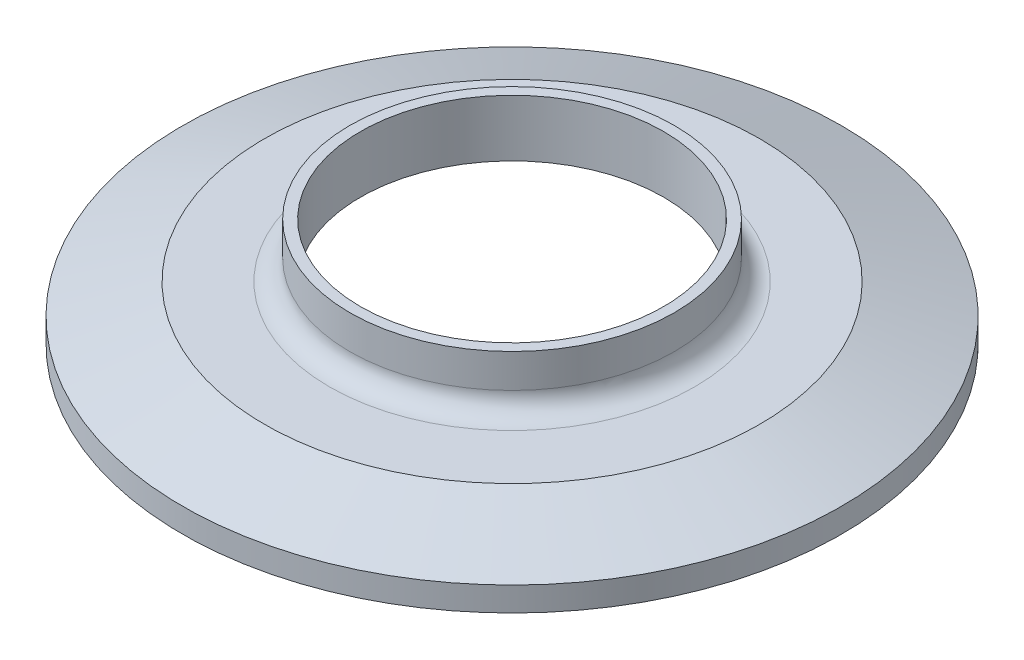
from build123d import *


with BuildPart() as part:
    # Sketch1 → Revolve1 (revolve)
    with BuildSketch(Plane.XY, mode=Mode.PRIVATE) as revolve1_sk:
        with BuildLine():
            Line((-19.05, 12.7), (-19.05, 8.7376))
            ThreePointArc((-19.05, 8.7376), (-19.749311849, 7.049311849), (-21.4376, 6.35))
            Line((-21.4376, 6.35), (-29.066442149, 6.35))
            Line((-29.066442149, 6.35), (-38.6969, 2.8448))
            Line((-38.6969, 2.8448), (-38.6969, 0))
            Line((-38.6969, 0), (-36.902872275, 0.002512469))
            ThreePointArc((-36.902872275, 0.002512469), (-36.468277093, 0.133310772), (-36.178066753, 0.482250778))
            Line((-36.178066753, 0.482250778), (-36.073244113, 0.729197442))
            ThreePointArc((-36.073244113, 0.729197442), (-35.3187, 1.228619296), (-34.564155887, 0.729197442))
            Line((-34.564155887, 0.729197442), (-34.397287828, 0.336080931))
            ThreePointArc((-34.397287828, 0.336080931), (-34.107077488, -0.012859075), (-33.672482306, -0.143657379))
            Line((-33.672482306, -0.143657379), (-30.099, 0))
            Line((-30.099, 0), (-17.8054, 6.022572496))
            Line((-17.8054, 6.022572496), (-17.8054, 12.7))
            Line((-17.8054, 12.7), (-19.05, 12.7))
        make_face()
    revolve(revolve1_sk.sketch.rotate(Axis((0, 0, 0), (0, 1, 0)), 270), axis=Axis((0, 0, 0), (0, 1, 0)))


solid = part.part
